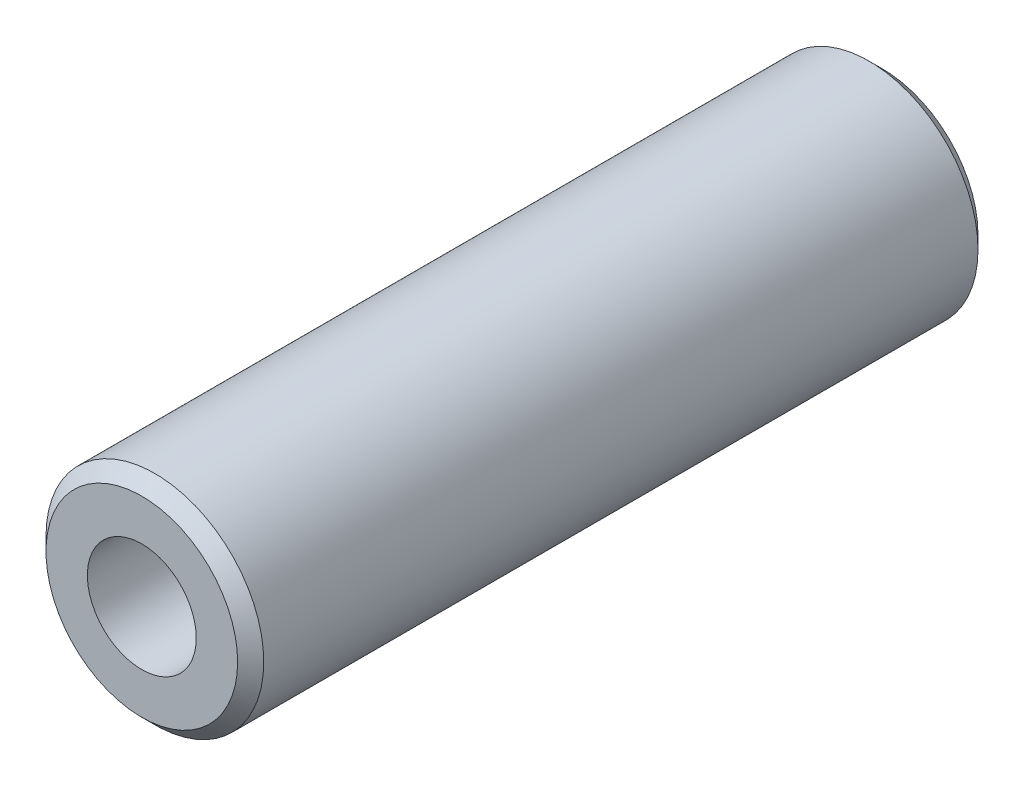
from build123d import *

# Parameters (mm, degrees)
SKETCH1_R           = 6.35
SKETCH1_R_2         = 3.175
BOSS_EXTRUDE1_DEPTH = 43.18
CHAMFER1_SIZE       = 0.762


with BuildPart() as part:
    # Sketch1 → Boss-Extrude1 (new body)
    with BuildSketch(Plane.XY):
        Circle(SKETCH1_R)
        Circle(SKETCH1_R_2, mode=Mode.SUBTRACT)
    extrude(amount=BOSS_EXTRUDE1_DEPTH)

    # Chamfer1
    chamfer1_edges = [part.edges().sort_by_distance(p)[0] for p in [
        (-6.35, 0, 0),
        (-6.35, 0, 43.18),
    ]]
    chamfer(chamfer1_edges, length=CHAMFER1_SIZE)


solid = part.part
